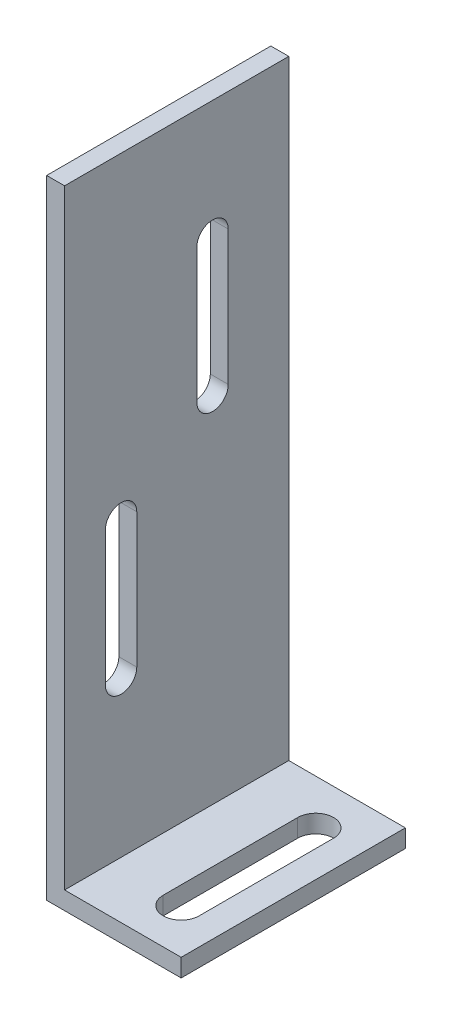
from build123d import *

# Parameters (mm, degrees)
BOSS_EXTRU_1_DEPTH      = 25
ENL_V_MAT_EXTRU_1_DEPTH = 74.986485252
ENL_V_MAT_EXTRU_2_DEPTH = 76.828754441


with BuildPart() as part:
    # Esquisse1 → Boss.-Extru.1 (new body)
    with BuildSketch(Plane.XY):
        Polygon((0, 70), (0, 0), (15, 0), (15, 2), (2, 2), (2, 70), align=None)
    extrude(amount=-BOSS_EXTRU_1_DEPTH)

    # Esquisse2 → Enl_v. mat.-Extru.1 (cut, through all)
    with BuildSketch(Plane(origin=(0, 2, 0), x_dir=(1, 0, 0), z_dir=(0, 1, 0))):
        with BuildLine():
            Line((8, 20), (8, 5))
            ThreePointArc((8, 5), (10, 3), (12, 5))
            Line((12, 5), (12, 20))
            ThreePointArc((12, 20), (10, 22), (8, 20))
        make_face()
    extrude(amount=-ENL_V_MAT_EXTRU_1_DEPTH, mode=Mode.SUBTRACT)

    # Esquisse3 → Enl_v. mat.-Extru.2 (cut, through all)
    with BuildSketch(Plane.ZY):
        with BuildLine():
            Line((-18.25, 56.7), (-18.25, 41.7))
            ThreePointArc((-18.25, 41.7), (-16.5, 39.95), (-14.75, 41.7))
            Line((-14.75, 41.7), (-14.75, 56.7))
            ThreePointArc((-14.75, 56.7), (-16.5, 58.45), (-18.25, 56.7))
        make_face()
        with BuildLine():
            Line((-8.05, 34.5), (-8.05, 19.5))
            ThreePointArc((-8.05, 19.5), (-6.3, 17.75), (-4.55, 19.5))
            Line((-4.55, 19.5), (-4.55, 34.5))
            ThreePointArc((-4.55, 34.5), (-6.3, 36.25), (-8.05, 34.5))
        make_face()
    extrude(amount=-ENL_V_MAT_EXTRU_2_DEPTH, mode=Mode.SUBTRACT)


solid = part.part
